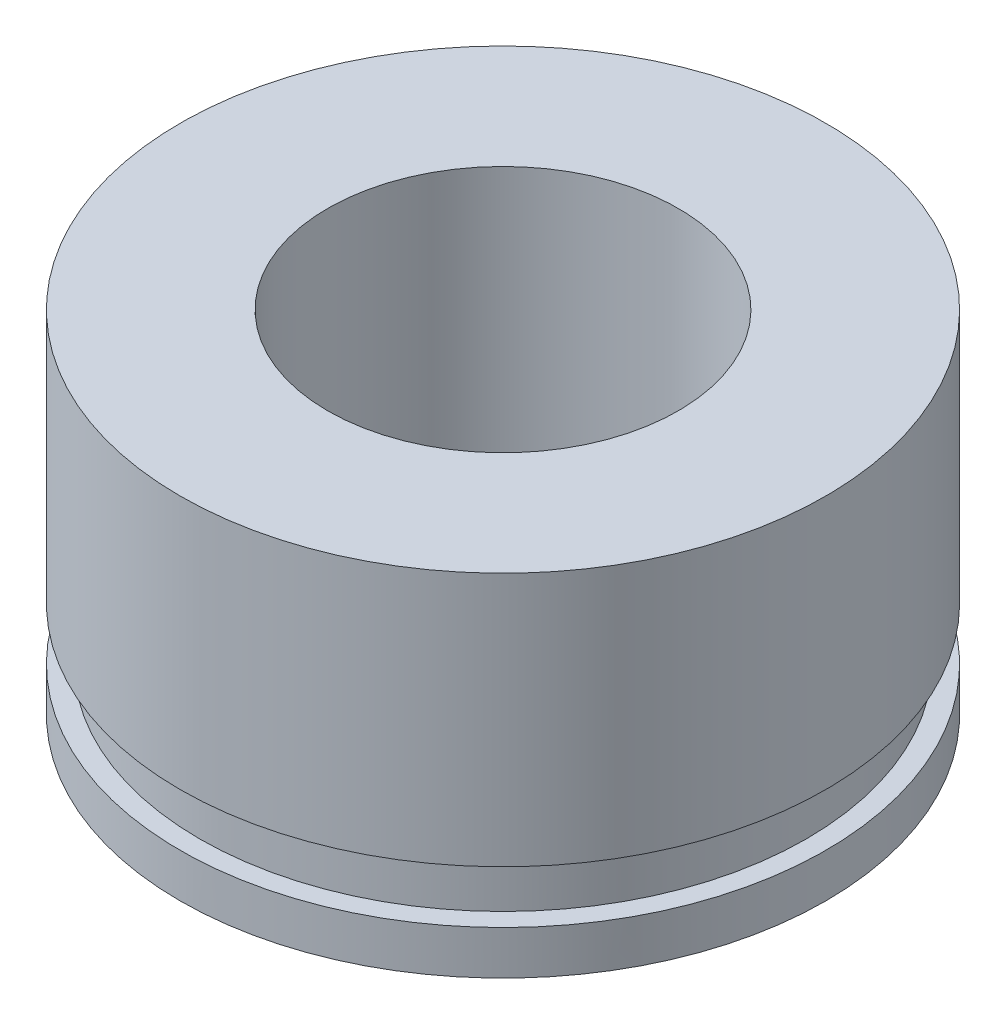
from build123d import *

# Parameters (mm, degrees)
SKETCH1_R          = 18.415
EXTRUDE1_DEPTH     = 20
SKETCH2_R          = 10
CUT_EXTRUDE1_DEPTH = 33.836328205
SKETCH3_W          = 1.798589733
SKETCH3_H          = 3


with BuildPart() as part:
    # Sketch1 → Extrude1 (new body)
    with BuildSketch(Plane(origin=(0, 0, 0), x_dir=(1, 0, 0), z_dir=(0, 1, 0))):
        with Locations(Location((0, 0, 0), (0, 0, 270))):
            Circle(SKETCH1_R)
    extrude(amount=EXTRUDE1_DEPTH)

    # Sketch2 → Cut-Extrude1 (cut, through all)
    with BuildSketch(Plane(origin=(0, 20, 0), x_dir=(-1, 0, 0), z_dir=(0, 1, 0))):
        with Locations(Location((0, 0, 0), (0, 0, 90))):
            Circle(SKETCH2_R)
    extrude(amount=-CUT_EXTRUDE1_DEPTH, mode=Mode.SUBTRACT)

    # Sketch3 → Cut-Revolve1 (revolve, cut)
    with BuildSketch(Plane(origin=(0, 0, 0), x_dir=(0, 0, -1), z_dir=(1, 0, 0))):
        with Locations((18.195035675, 4)):
            Rectangle(SKETCH3_W, SKETCH3_H)
    revolve(axis=Axis((0, 0, 0), (0, 1, 0)), mode=Mode.SUBTRACT)


solid = part.part
